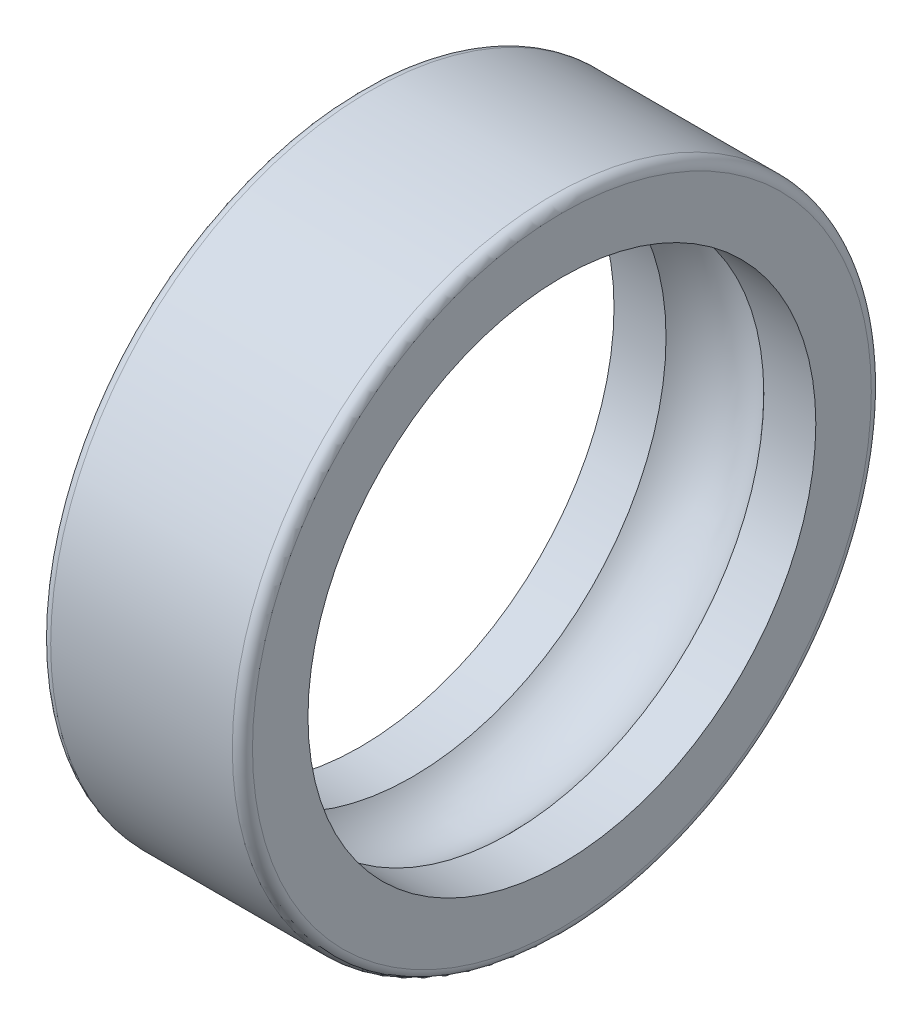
ISO-10303-21;
HEADER;
FILE_DESCRIPTION(('STEP AP214'),'2;1');
FILE_NAME('part.step','',(''),(''),'','','');
FILE_SCHEMA(('AUTOMOTIVE_DESIGN { 1 0 10303 214 1 1 1 1 }'));
ENDSEC;
DATA;
#1=APPLICATION_CONTEXT('core data for automotive mechanical design processes');
#2=APPLICATION_PROTOCOL_DEFINITION('international standard','automotive_design',2000,#1);
#3=PRODUCT_CONTEXT('',#1,'mechanical');
#4=PRODUCT('Part','Part','',(#3));
#5=PRODUCT_RELATED_PRODUCT_CATEGORY('part','',(#4));
#6=PRODUCT_DEFINITION_FORMATION('','',#4);
#7=PRODUCT_DEFINITION_CONTEXT('part definition',#1,'design');
#8=PRODUCT_DEFINITION('design','',#6,#7);
#9=PRODUCT_DEFINITION_SHAPE('','',#8);
#10=(LENGTH_UNIT() NAMED_UNIT(*) SI_UNIT(.MILLI.,.METRE.));
#11=(NAMED_UNIT(*) PLANE_ANGLE_UNIT() SI_UNIT($,.RADIAN.));
#12=(NAMED_UNIT(*) SI_UNIT($,.STERADIAN.) SOLID_ANGLE_UNIT());
#13=UNCERTAINTY_MEASURE_WITH_UNIT(LENGTH_MEASURE(1.E-05),#10,'distance_accuracy_value','');
#14=(GEOMETRIC_REPRESENTATION_CONTEXT(3) GLOBAL_UNCERTAINTY_ASSIGNED_CONTEXT((#13)) GLOBAL_UNIT_ASSIGNED_CONTEXT((#10,
#11,#12)) REPRESENTATION_CONTEXT('',''));
#15=CARTESIAN_POINT('',(0.,0.,0.));
#16=DIRECTION('',(0.,0.,1.));
#17=DIRECTION('',(1.,0.,0.));
#18=AXIS2_PLACEMENT_3D('',#15,#16,#17);
#19=CARTESIAN_POINT('',(0.3,0.,0.));
#20=DIRECTION('',(-1.,0.,0.));
#21=DIRECTION('',(0.,0.,1.));
#22=AXIS2_PLACEMENT_3D('',#19,#20,#21);
#23=TOROIDAL_SURFACE('',#22,9.2,0.300000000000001);
#24=CARTESIAN_POINT('',(0.,0.,0.));
#25=DIRECTION('',(-1.,0.,0.));
#26=DIRECTION('',(0.,0.,1.));
#27=AXIS2_PLACEMENT_3D('',#24,#25,#26);
#28=CIRCLE('',#27,9.2);
#29=CARTESIAN_POINT('',(0.,0.,9.2));
#30=VERTEX_POINT('',#29);
#31=EDGE_CURVE('E10',#30,#30,#28,.T.);
#32=ORIENTED_EDGE('',*,*,#31,.F.);
#33=EDGE_LOOP('',(#32));
#34=FACE_BOUND('',#33,.T.);
#35=CARTESIAN_POINT('',(0.3,0.,0.));
#36=DIRECTION('',(-1.,0.,0.));
#37=DIRECTION('',(0.,0.,1.));
#38=AXIS2_PLACEMENT_3D('',#35,#36,#37);
#39=CIRCLE('',#38,9.5);
#40=CARTESIAN_POINT('',(0.3,0.,9.5));
#41=VERTEX_POINT('',#40);
#42=EDGE_CURVE('E57',#41,#41,#39,.T.);
#43=ORIENTED_EDGE('',*,*,#42,.T.);
#44=EDGE_LOOP('',(#43));
#45=FACE_BOUND('',#44,.T.);
#46=ADVANCED_FACE('F29',(#34,#45),#23,.T.);
#47=CARTESIAN_POINT('',(0.,0.,-9.2));
#48=DIRECTION('',(1.,0.,0.));
#49=DIRECTION('',(0.,0.,-1.));
#50=AXIS2_PLACEMENT_3D('',#47,#48,#49);
#51=PLANE('',#50);
#52=CARTESIAN_POINT('',(0.,0.,0.));
#53=DIRECTION('',(-1.,0.,0.));
#54=DIRECTION('',(0.,0.,1.));
#55=AXIS2_PLACEMENT_3D('',#52,#53,#54);
#56=CIRCLE('',#55,7.55);
#57=CARTESIAN_POINT('',(0.,0.,7.55));
#58=VERTEX_POINT('',#57);
#59=EDGE_CURVE('E35',#58,#58,#56,.T.);
#60=ORIENTED_EDGE('',*,*,#59,.F.);
#61=EDGE_LOOP('',(#60));
#62=FACE_BOUND('',#61,.T.);
#63=ORIENTED_EDGE('',*,*,#31,.T.);
#64=EDGE_LOOP('',(#63));
#65=FACE_BOUND('',#64,.T.);
#66=ADVANCED_FACE('F94',(#62,#65),#51,.F.);
#67=CARTESIAN_POINT('',(0.,0.,0.));
#68=DIRECTION('',(-1.,0.,0.));
#69=DIRECTION('',(0.,0.,1.));
#70=AXIS2_PLACEMENT_3D('',#67,#68,#69);
#71=CYLINDRICAL_SURFACE('',#70,7.55);
#72=CARTESIAN_POINT('',(1.54655581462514,0.,0.));
#73=DIRECTION('',(-1.,0.,0.));
#74=DIRECTION('',(0.,0.,1.));
#75=AXIS2_PLACEMENT_3D('',#72,#73,#74);
#76=CIRCLE('',#75,7.55);
#77=CARTESIAN_POINT('',(1.54655581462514,0.,7.55));
#78=VERTEX_POINT('',#77);
#79=EDGE_CURVE('E39',#78,#78,#76,.T.);
#80=ORIENTED_EDGE('',*,*,#79,.F.);
#81=EDGE_LOOP('',(#80));
#82=FACE_BOUND('',#81,.T.);
#83=ORIENTED_EDGE('',*,*,#59,.T.);
#84=EDGE_LOOP('',(#83));
#85=FACE_BOUND('',#84,.T.);
#86=ADVANCED_FACE('F89',(#82,#85),#71,.F.);
#87=CARTESIAN_POINT('',(3.,0.,0.));
#88=DIRECTION('',(-1.,0.,0.));
#89=DIRECTION('',(0.,0.,1.));
#90=AXIS2_PLACEMENT_3D('',#87,#88,#89);
#91=TOROIDAL_SURFACE('',#90,6.25,1.95);
#92=CARTESIAN_POINT('',(4.45344418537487,0.,0.));
#93=DIRECTION('',(-1.,0.,0.));
#94=DIRECTION('',(0.,0.,1.));
#95=AXIS2_PLACEMENT_3D('',#92,#93,#94);
#96=CIRCLE('',#95,7.55);
#97=CARTESIAN_POINT('',(4.45344418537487,0.,7.55));
#98=VERTEX_POINT('',#97);
#99=EDGE_CURVE('E43',#98,#98,#96,.T.);
#100=ORIENTED_EDGE('',*,*,#99,.F.);
#101=EDGE_LOOP('',(#100));
#102=FACE_BOUND('',#101,.T.);
#103=ORIENTED_EDGE('',*,*,#79,.T.);
#104=EDGE_LOOP('',(#103));
#105=FACE_BOUND('',#104,.T.);
#106=ADVANCED_FACE('F83',(#102,#105),#91,.F.);
#107=CARTESIAN_POINT('',(0.,0.,0.));
#108=DIRECTION('',(-1.,0.,0.));
#109=DIRECTION('',(0.,0.,1.));
#110=AXIS2_PLACEMENT_3D('',#107,#108,#109);
#111=CYLINDRICAL_SURFACE('',#110,7.55);
#112=CARTESIAN_POINT('',(6.,0.,0.));
#113=DIRECTION('',(-1.,0.,0.));
#114=DIRECTION('',(0.,0.,1.));
#115=AXIS2_PLACEMENT_3D('',#112,#113,#114);
#116=CIRCLE('',#115,7.55);
#117=CARTESIAN_POINT('',(6.,0.,7.55));
#118=VERTEX_POINT('',#117);
#119=EDGE_CURVE('E48',#118,#118,#116,.T.);
#120=ORIENTED_EDGE('',*,*,#119,.F.);
#121=EDGE_LOOP('',(#120));
#122=FACE_BOUND('',#121,.T.);
#123=ORIENTED_EDGE('',*,*,#99,.T.);
#124=EDGE_LOOP('',(#123));
#125=FACE_BOUND('',#124,.T.);
#126=ADVANCED_FACE('F77',(#122,#125),#111,.F.);
#127=CARTESIAN_POINT('',(6.00000000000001,0.,-9.2));
#128=DIRECTION('',(-1.,0.,0.));
#129=DIRECTION('',(0.,0.,1.));
#130=AXIS2_PLACEMENT_3D('',#127,#128,#129);
#131=PLANE('',#130);
#132=CARTESIAN_POINT('',(6.00000000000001,0.,0.));
#133=DIRECTION('',(-1.,0.,0.));
#134=DIRECTION('',(0.,0.,1.));
#135=AXIS2_PLACEMENT_3D('',#132,#133,#134);
#136=CIRCLE('',#135,9.2);
#137=CARTESIAN_POINT('',(6.00000000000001,0.,9.2));
#138=VERTEX_POINT('',#137);
#139=EDGE_CURVE('E51',#138,#138,#136,.T.);
#140=ORIENTED_EDGE('',*,*,#139,.F.);
#141=EDGE_LOOP('',(#140));
#142=FACE_BOUND('',#141,.T.);
#143=ORIENTED_EDGE('',*,*,#119,.T.);
#144=EDGE_LOOP('',(#143));
#145=FACE_BOUND('',#144,.T.);
#146=ADVANCED_FACE('F71',(#142,#145),#131,.F.);
#147=CARTESIAN_POINT('',(5.7,0.,0.));
#148=DIRECTION('',(-1.,0.,0.));
#149=DIRECTION('',(0.,0.,1.));
#150=AXIS2_PLACEMENT_3D('',#147,#148,#149);
#151=TOROIDAL_SURFACE('',#150,9.2,0.300000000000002);
#152=CARTESIAN_POINT('',(5.7,0.,0.));
#153=DIRECTION('',(-1.,0.,0.));
#154=DIRECTION('',(0.,0.,1.));
#155=AXIS2_PLACEMENT_3D('',#152,#153,#154);
#156=CIRCLE('',#155,9.5);
#157=CARTESIAN_POINT('',(5.7,0.,9.5));
#158=VERTEX_POINT('',#157);
#159=EDGE_CURVE('E54',#158,#158,#156,.T.);
#160=ORIENTED_EDGE('',*,*,#159,.F.);
#161=EDGE_LOOP('',(#160));
#162=FACE_BOUND('',#161,.T.);
#163=ORIENTED_EDGE('',*,*,#139,.T.);
#164=EDGE_LOOP('',(#163));
#165=FACE_BOUND('',#164,.T.);
#166=ADVANCED_FACE('F65',(#162,#165),#151,.T.);
#167=CARTESIAN_POINT('',(0.,0.,0.));
#168=DIRECTION('',(-1.,0.,0.));
#169=DIRECTION('',(0.,0.,1.));
#170=AXIS2_PLACEMENT_3D('',#167,#168,#169);
#171=CYLINDRICAL_SURFACE('',#170,9.5);
#172=ORIENTED_EDGE('',*,*,#42,.F.);
#173=EDGE_LOOP('',(#172));
#174=FACE_BOUND('',#173,.T.);
#175=ORIENTED_EDGE('',*,*,#159,.T.);
#176=EDGE_LOOP('',(#175));
#177=FACE_BOUND('',#176,.T.);
#178=ADVANCED_FACE('F62',(#174,#177),#171,.T.);
#179=CLOSED_SHELL('',(#46,#66,#86,#106,#126,#146,#166,#178));
#180=MANIFOLD_SOLID_BREP('B2',#179);
#181=ADVANCED_BREP_SHAPE_REPRESENTATION('',(#18,#180),#14);
#182=SHAPE_DEFINITION_REPRESENTATION(#9,#181);
ENDSEC;
END-ISO-10303-21;
